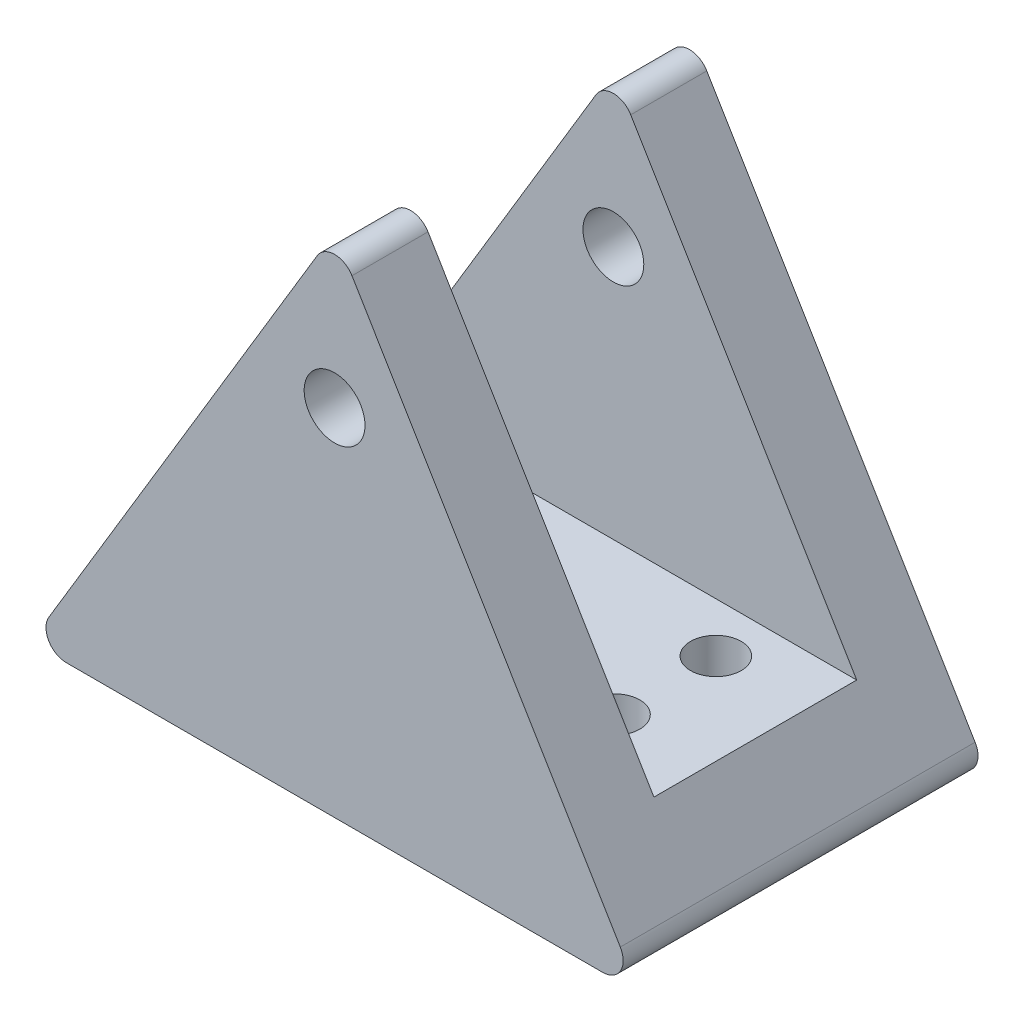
ISO-10303-21;
HEADER;
FILE_DESCRIPTION(('STEP AP214'),'2;1');
FILE_NAME('part.step','',(''),(''),'','','');
FILE_SCHEMA(('AUTOMOTIVE_DESIGN { 1 0 10303 214 1 1 1 1 }'));
ENDSEC;
DATA;
#1=APPLICATION_CONTEXT('core data for automotive mechanical design processes');
#2=APPLICATION_PROTOCOL_DEFINITION('international standard','automotive_design',2000,#1);
#3=PRODUCT_CONTEXT('',#1,'mechanical');
#4=PRODUCT('Part','Part','',(#3));
#5=PRODUCT_RELATED_PRODUCT_CATEGORY('part','',(#4));
#6=PRODUCT_DEFINITION_FORMATION('','',#4);
#7=PRODUCT_DEFINITION_CONTEXT('part definition',#1,'design');
#8=PRODUCT_DEFINITION('design','',#6,#7);
#9=PRODUCT_DEFINITION_SHAPE('','',#8);
#10=(LENGTH_UNIT() NAMED_UNIT(*) SI_UNIT(.MILLI.,.METRE.));
#11=(NAMED_UNIT(*) PLANE_ANGLE_UNIT() SI_UNIT($,.RADIAN.));
#12=(NAMED_UNIT(*) SI_UNIT($,.STERADIAN.) SOLID_ANGLE_UNIT());
#13=UNCERTAINTY_MEASURE_WITH_UNIT(LENGTH_MEASURE(1.E-05),#10,'distance_accuracy_value','');
#14=(GEOMETRIC_REPRESENTATION_CONTEXT(3) GLOBAL_UNCERTAINTY_ASSIGNED_CONTEXT((#13)) GLOBAL_UNIT_ASSIGNED_CONTEXT((#10,
#11,#12)) REPRESENTATION_CONTEXT('',''));
#15=CARTESIAN_POINT('',(0.,0.,0.));
#16=DIRECTION('',(0.,0.,1.));
#17=DIRECTION('',(1.,0.,0.));
#18=AXIS2_PLACEMENT_3D('',#15,#16,#17);
#19=CARTESIAN_POINT('',(-38.1,-31.75,44.45));
#20=DIRECTION('',(0.,1.,0.));
#21=DIRECTION('',(0.,0.,1.));
#22=AXIS2_PLACEMENT_3D('',#19,#20,#21);
#23=PLANE('',#22);
#24=CARTESIAN_POINT('',(-19.05,-31.75,28.4370332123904));
#25=DIRECTION('',(0.,1.,0.));
#26=DIRECTION('',(0.,0.,1.));
#27=AXIS2_PLACEMENT_3D('',#24,#25,#26);
#28=CIRCLE('',#27,3.17499999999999);
#29=CARTESIAN_POINT('',(-19.05,-31.75,31.6120332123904));
#30=VERTEX_POINT('',#29);
#31=EDGE_CURVE('E206',#30,#30,#28,.T.);
#32=ORIENTED_EDGE('',*,*,#31,.T.);
#33=EDGE_LOOP('',(#32));
#34=FACE_BOUND('',#33,.T.);
#35=CARTESIAN_POINT('',(19.05,-31.75,28.4370332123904));
#36=DIRECTION('',(0.,1.,0.));
#37=DIRECTION('',(0.,0.,1.));
#38=AXIS2_PLACEMENT_3D('',#35,#36,#37);
#39=CIRCLE('',#38,3.175);
#40=CARTESIAN_POINT('',(19.05,-31.75,31.6120332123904));
#41=VERTEX_POINT('',#40);
#42=EDGE_CURVE('E210',#41,#41,#39,.T.);
#43=ORIENTED_EDGE('',*,*,#42,.T.);
#44=EDGE_LOOP('',(#43));
#45=FACE_BOUND('',#44,.T.);
#46=CARTESIAN_POINT('',(19.05,-31.75,15.7370332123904));
#47=DIRECTION('',(0.,1.,0.));
#48=DIRECTION('',(0.,0.,1.));
#49=AXIS2_PLACEMENT_3D('',#46,#47,#48);
#50=CIRCLE('',#49,3.175);
#51=CARTESIAN_POINT('',(19.05,-31.75,18.9120332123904));
#52=VERTEX_POINT('',#51);
#53=EDGE_CURVE('E213',#52,#52,#50,.T.);
#54=ORIENTED_EDGE('',*,*,#53,.T.);
#55=EDGE_LOOP('',(#54));
#56=FACE_BOUND('',#55,.T.);
#57=CARTESIAN_POINT('',(-19.05,-31.75,15.7370332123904));
#58=DIRECTION('',(0.,1.,0.));
#59=DIRECTION('',(0.,0.,1.));
#60=AXIS2_PLACEMENT_3D('',#57,#58,#59);
#61=CIRCLE('',#60,3.175);
#62=CARTESIAN_POINT('',(-19.05,-31.75,18.9120332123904));
#63=VERTEX_POINT('',#62);
#64=EDGE_CURVE('E216',#63,#63,#61,.T.);
#65=ORIENTED_EDGE('',*,*,#64,.T.);
#66=EDGE_LOOP('',(#65));
#67=FACE_BOUND('',#66,.T.);
#68=DIRECTION('',(1.,0.,0.));
#69=VECTOR('',#68,1.);
#70=CARTESIAN_POINT('',(-38.1,-31.75,0.));
#71=LINE('',#70,#69);
#72=CARTESIAN_POINT('',(-33.6138764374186,-31.75,0.));
#73=VERTEX_POINT('',#72);
#74=CARTESIAN_POINT('',(33.6138764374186,-31.75,0.));
#75=VERTEX_POINT('',#74);
#76=EDGE_CURVE('E138',#73,#75,#71,.T.);
#77=ORIENTED_EDGE('',*,*,#76,.T.);
#78=DIRECTION('',(0.,0.,-1.));
#79=VECTOR('',#78,1.);
#80=CARTESIAN_POINT('',(33.6138764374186,-31.75,44.45));
#81=LINE('',#80,#79);
#82=CARTESIAN_POINT('',(33.6138764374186,-31.75,44.45));
#83=VERTEX_POINT('',#82);
#84=EDGE_CURVE('E170',#75,#83,#81,.F.);
#85=ORIENTED_EDGE('',*,*,#84,.T.);
#86=DIRECTION('',(1.,0.,0.));
#87=VECTOR('',#86,1.);
#88=CARTESIAN_POINT('',(-38.1,-31.75,44.45));
#89=LINE('',#88,#87);
#90=CARTESIAN_POINT('',(-33.6138764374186,-31.75,44.45));
#91=VERTEX_POINT('',#90);
#92=EDGE_CURVE('E142',#91,#83,#89,.T.);
#93=ORIENTED_EDGE('',*,*,#92,.F.);
#94=DIRECTION('',(0.,0.,-1.));
#95=VECTOR('',#94,1.);
#96=CARTESIAN_POINT('',(-33.6138764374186,-31.75,44.45));
#97=LINE('',#96,#95);
#98=EDGE_CURVE('E167',#91,#73,#97,.T.);
#99=ORIENTED_EDGE('',*,*,#98,.T.);
#100=EDGE_LOOP('',(#77,#85,#93,#99));
#101=FACE_BOUND('',#100,.T.);
#102=ADVANCED_FACE('F34',(#34,#45,#56,#67,#101),#23,.F.);
#103=CARTESIAN_POINT('',(0.,0.,44.45));
#104=DIRECTION('',(0.,0.,1.));
#105=DIRECTION('',(1.,0.,0.));
#106=AXIS2_PLACEMENT_3D('',#103,#104,#105);
#107=PLANE('',#106);
#108=CARTESIAN_POINT('',(0.,12.7,44.45));
#109=DIRECTION('',(0.,0.,1.));
#110=DIRECTION('',(1.,0.,0.));
#111=AXIS2_PLACEMENT_3D('',#108,#109,#110);
#112=CIRCLE('',#111,3.81);
#113=CARTESIAN_POINT('',(3.81,12.7,44.45));
#114=VERTEX_POINT('',#113);
#115=EDGE_CURVE('E233',#114,#114,#112,.T.);
#116=ORIENTED_EDGE('',*,*,#115,.F.);
#117=EDGE_LOOP('',(#116));
#118=FACE_BOUND('',#117,.T.);
#119=ORIENTED_EDGE('',*,*,#92,.T.);
#120=CARTESIAN_POINT('',(33.6138764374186,-29.21,44.45));
#121=DIRECTION('',(0.,0.,1.));
#122=DIRECTION('',(1.,0.,0.));
#123=AXIS2_PLACEMENT_3D('',#120,#121,#122);
#124=CIRCLE('',#123,2.54);
#125=CARTESIAN_POINT('',(35.7919084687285,-27.9031807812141,44.45));
#126=VERTEX_POINT('',#125);
#127=EDGE_CURVE('E176',#83,#126,#124,.T.);
#128=ORIENTED_EDGE('',*,*,#127,.T.);
#129=DIRECTION('',(0.514495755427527,-0.857492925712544,0.));
#130=VECTOR('',#129,1.);
#131=CARTESIAN_POINT('',(0.,31.75,44.45));
#132=LINE('',#131,#130);
#133=CARTESIAN_POINT('',(2.17803203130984,28.1199466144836,44.45));
#134=VERTEX_POINT('',#133);
#135=EDGE_CURVE('E204',#134,#126,#132,.T.);
#136=ORIENTED_EDGE('',*,*,#135,.F.);
#137=CARTESIAN_POINT('',(0.,26.8131273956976,44.45));
#138=DIRECTION('',(0.,0.,1.));
#139=DIRECTION('',(1.,0.,0.));
#140=AXIS2_PLACEMENT_3D('',#137,#138,#139);
#141=CIRCLE('',#140,2.54);
#142=CARTESIAN_POINT('',(-2.17803203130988,28.1199466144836,44.45));
#143=VERTEX_POINT('',#142);
#144=EDGE_CURVE('E174',#134,#143,#141,.T.);
#145=ORIENTED_EDGE('',*,*,#144,.T.);
#146=DIRECTION('',(0.514495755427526,0.857492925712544,0.));
#147=VECTOR('',#146,1.);
#148=CARTESIAN_POINT('',(-38.1,-31.75,44.45));
#149=LINE('',#148,#147);
#150=CARTESIAN_POINT('',(-35.7919084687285,-27.9031807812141,44.45));
#151=VERTEX_POINT('',#150);
#152=EDGE_CURVE('E195',#151,#143,#149,.T.);
#153=ORIENTED_EDGE('',*,*,#152,.F.);
#154=CARTESIAN_POINT('',(-33.6138764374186,-29.21,44.45));
#155=DIRECTION('',(0.,0.,1.));
#156=DIRECTION('',(1.,0.,0.));
#157=AXIS2_PLACEMENT_3D('',#154,#155,#156);
#158=CIRCLE('',#157,2.54);
#159=EDGE_CURVE('E172',#151,#91,#158,.T.);
#160=ORIENTED_EDGE('',*,*,#159,.T.);
#161=EDGE_LOOP('',(#119,#128,#136,#145,#153,#160));
#162=FACE_BOUND('',#161,.T.);
#163=ADVANCED_FACE('F256',(#118,#162),#107,.T.);
#164=CARTESIAN_POINT('',(0.,0.,0.));
#165=DIRECTION('',(0.,0.,1.));
#166=DIRECTION('',(1.,0.,0.));
#167=AXIS2_PLACEMENT_3D('',#164,#165,#166);
#168=PLANE('',#167);
#169=CARTESIAN_POINT('',(0.,12.7,0.));
#170=DIRECTION('',(0.,0.,1.));
#171=DIRECTION('',(1.,0.,0.));
#172=AXIS2_PLACEMENT_3D('',#169,#170,#171);
#173=CIRCLE('',#172,3.81);
#174=CARTESIAN_POINT('',(3.81,12.7,0.));
#175=VERTEX_POINT('',#174);
#176=EDGE_CURVE('E154',#175,#175,#173,.T.);
#177=ORIENTED_EDGE('',*,*,#176,.T.);
#178=EDGE_LOOP('',(#177));
#179=FACE_BOUND('',#178,.T.);
#180=DIRECTION('',(0.514495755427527,-0.857492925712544,0.));
#181=VECTOR('',#180,1.);
#182=CARTESIAN_POINT('',(0.,31.75,0.));
#183=LINE('',#182,#181);
#184=CARTESIAN_POINT('',(2.17803203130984,28.1199466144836,0.));
#185=VERTEX_POINT('',#184);
#186=CARTESIAN_POINT('',(35.7919084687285,-27.9031807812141,0.));
#187=VERTEX_POINT('',#186);
#188=EDGE_CURVE('E120',#185,#187,#183,.T.);
#189=ORIENTED_EDGE('',*,*,#188,.T.);
#190=CARTESIAN_POINT('',(33.6138764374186,-29.21,0.));
#191=DIRECTION('',(0.,0.,1.));
#192=DIRECTION('',(1.,0.,0.));
#193=AXIS2_PLACEMENT_3D('',#190,#191,#192);
#194=CIRCLE('',#193,2.54);
#195=EDGE_CURVE('E165',#187,#75,#194,.F.);
#196=ORIENTED_EDGE('',*,*,#195,.T.);
#197=ORIENTED_EDGE('',*,*,#76,.F.);
#198=CARTESIAN_POINT('',(-33.6138764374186,-29.21,0.));
#199=DIRECTION('',(0.,0.,1.));
#200=DIRECTION('',(1.,0.,0.));
#201=AXIS2_PLACEMENT_3D('',#198,#199,#200);
#202=CIRCLE('',#201,2.54);
#203=CARTESIAN_POINT('',(-35.7919084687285,-27.9031807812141,0.));
#204=VERTEX_POINT('',#203);
#205=EDGE_CURVE('E161',#73,#204,#202,.F.);
#206=ORIENTED_EDGE('',*,*,#205,.T.);
#207=DIRECTION('',(0.514495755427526,0.857492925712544,0.));
#208=VECTOR('',#207,1.);
#209=CARTESIAN_POINT('',(-38.1,-31.75,0.));
#210=LINE('',#209,#208);
#211=CARTESIAN_POINT('',(-2.17803203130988,28.1199466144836,0.));
#212=VERTEX_POINT('',#211);
#213=EDGE_CURVE('E186',#204,#212,#210,.T.);
#214=ORIENTED_EDGE('',*,*,#213,.T.);
#215=CARTESIAN_POINT('',(0.,26.8131273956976,0.));
#216=DIRECTION('',(0.,0.,1.));
#217=DIRECTION('',(1.,0.,0.));
#218=AXIS2_PLACEMENT_3D('',#215,#216,#217);
#219=CIRCLE('',#218,2.54);
#220=EDGE_CURVE('E163',#212,#185,#219,.F.);
#221=ORIENTED_EDGE('',*,*,#220,.T.);
#222=EDGE_LOOP('',(#189,#196,#197,#206,#214,#221));
#223=FACE_BOUND('',#222,.T.);
#224=ADVANCED_FACE('F192',(#179,#223),#168,.F.);
#225=CARTESIAN_POINT('',(-38.1,31.75,9.52500000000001));
#226=DIRECTION('',(0.,0.,-1.));
#227=DIRECTION('',(0.,1.,0.));
#228=AXIS2_PLACEMENT_3D('',#225,#226,#227);
#229=PLANE('',#228);
#230=CARTESIAN_POINT('',(0.,12.7,9.525));
#231=DIRECTION('',(0.,0.,-1.));
#232=DIRECTION('',(0.,1.,0.));
#233=AXIS2_PLACEMENT_3D('',#230,#231,#232);
#234=CIRCLE('',#233,3.81);
#235=CARTESIAN_POINT('',(0.,16.51,9.525));
#236=VERTEX_POINT('',#235);
#237=EDGE_CURVE('E153',#236,#236,#234,.T.);
#238=ORIENTED_EDGE('',*,*,#237,.T.);
#239=EDGE_LOOP('',(#238));
#240=FACE_BOUND('',#239,.T.);
#241=DIRECTION('',(-0.514495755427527,0.857492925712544,0.));
#242=VECTOR('',#241,1.);
#243=CARTESIAN_POINT('',(-10.0852941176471,48.5588235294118,9.52500000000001));
#244=LINE('',#243,#242);
#245=CARTESIAN_POINT('',(30.48,-19.05,9.52499999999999));
#246=VERTEX_POINT('',#245);
#247=CARTESIAN_POINT('',(2.17803203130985,28.1199466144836,9.52500000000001));
#248=VERTEX_POINT('',#247);
#249=EDGE_CURVE('E126',#246,#248,#244,.T.);
#250=ORIENTED_EDGE('',*,*,#249,.T.);
#251=CARTESIAN_POINT('',(0.,26.8131273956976,9.525));
#252=DIRECTION('',(0.,0.,-1.));
#253=DIRECTION('',(0.,1.,0.));
#254=AXIS2_PLACEMENT_3D('',#251,#252,#253);
#255=CIRCLE('',#254,2.54);
#256=CARTESIAN_POINT('',(-2.17803203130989,28.1199466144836,9.525));
#257=VERTEX_POINT('',#256);
#258=EDGE_CURVE('E11',#248,#257,#255,.F.);
#259=ORIENTED_EDGE('',*,*,#258,.T.);
#260=DIRECTION('',(-0.514495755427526,-0.857492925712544,0.));
#261=VECTOR('',#260,1.);
#262=CARTESIAN_POINT('',(-10.0852941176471,14.9411764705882,9.525));
#263=LINE('',#262,#261);
#264=CARTESIAN_POINT('',(-30.48,-19.05,9.52499999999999));
#265=VERTEX_POINT('',#264);
#266=EDGE_CURVE('E136',#257,#265,#263,.T.);
#267=ORIENTED_EDGE('',*,*,#266,.T.);
#268=DIRECTION('',(1.,0.,0.));
#269=VECTOR('',#268,1.);
#270=CARTESIAN_POINT('',(-38.1,-19.05,9.52499999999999));
#271=LINE('',#270,#269);
#272=EDGE_CURVE('E135',#265,#246,#271,.T.);
#273=ORIENTED_EDGE('',*,*,#272,.T.);
#274=EDGE_LOOP('',(#250,#259,#267,#273));
#275=FACE_BOUND('',#274,.T.);
#276=ADVANCED_FACE('F199',(#240,#275),#229,.F.);
#277=CARTESIAN_POINT('',(-38.1,-19.05,34.925));
#278=DIRECTION('',(0.,-1.,0.));
#279=DIRECTION('',(0.,0.,-1.));
#280=AXIS2_PLACEMENT_3D('',#277,#278,#279);
#281=PLANE('',#280);
#282=CARTESIAN_POINT('',(-19.05,-19.05,28.4370332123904));
#283=DIRECTION('',(0.,1.,0.));
#284=DIRECTION('',(1.,0.,0.));
#285=AXIS2_PLACEMENT_3D('',#282,#283,#284);
#286=CIRCLE('',#285,3.17499999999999);
#287=CARTESIAN_POINT('',(-15.875,-19.05,28.4370332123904));
#288=VERTEX_POINT('',#287);
#289=EDGE_CURVE('E223',#288,#288,#286,.T.);
#290=ORIENTED_EDGE('',*,*,#289,.F.);
#291=EDGE_LOOP('',(#290));
#292=FACE_BOUND('',#291,.T.);
#293=CARTESIAN_POINT('',(19.05,-19.05,28.4370332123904));
#294=DIRECTION('',(0.,1.,0.));
#295=DIRECTION('',(-1.,0.,0.));
#296=AXIS2_PLACEMENT_3D('',#293,#294,#295);
#297=CIRCLE('',#296,3.175);
#298=CARTESIAN_POINT('',(15.875,-19.05,28.4370332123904));
#299=VERTEX_POINT('',#298);
#300=EDGE_CURVE('E226',#299,#299,#297,.T.);
#301=ORIENTED_EDGE('',*,*,#300,.F.);
#302=EDGE_LOOP('',(#301));
#303=FACE_BOUND('',#302,.T.);
#304=CARTESIAN_POINT('',(19.05,-19.05,15.7370332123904));
#305=DIRECTION('',(0.,1.,0.));
#306=DIRECTION('',(1.,0.,0.));
#307=AXIS2_PLACEMENT_3D('',#304,#305,#306);
#308=CIRCLE('',#307,3.175);
#309=CARTESIAN_POINT('',(22.225,-19.05,15.7370332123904));
#310=VERTEX_POINT('',#309);
#311=EDGE_CURVE('E222',#310,#310,#308,.T.);
#312=ORIENTED_EDGE('',*,*,#311,.F.);
#313=EDGE_LOOP('',(#312));
#314=FACE_BOUND('',#313,.T.);
#315=CARTESIAN_POINT('',(-19.05,-19.05,15.7370332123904));
#316=DIRECTION('',(0.,1.,0.));
#317=DIRECTION('',(-1.,0.,0.));
#318=AXIS2_PLACEMENT_3D('',#315,#316,#317);
#319=CIRCLE('',#318,3.175);
#320=CARTESIAN_POINT('',(-22.225,-19.05,15.7370332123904));
#321=VERTEX_POINT('',#320);
#322=EDGE_CURVE('E219',#321,#321,#319,.T.);
#323=ORIENTED_EDGE('',*,*,#322,.F.);
#324=EDGE_LOOP('',(#323));
#325=FACE_BOUND('',#324,.T.);
#326=DIRECTION('',(1.,0.,0.));
#327=VECTOR('',#326,1.);
#328=CARTESIAN_POINT('',(-38.1,-19.05,34.925));
#329=LINE('',#328,#327);
#330=CARTESIAN_POINT('',(-30.48,-19.05,34.925));
#331=VERTEX_POINT('',#330);
#332=CARTESIAN_POINT('',(30.48,-19.05,34.925));
#333=VERTEX_POINT('',#332);
#334=EDGE_CURVE('E114',#331,#333,#329,.T.);
#335=ORIENTED_EDGE('',*,*,#334,.T.);
#336=DIRECTION('',(0.,0.,-1.));
#337=VECTOR('',#336,1.);
#338=CARTESIAN_POINT('',(30.48,-19.05,34.925));
#339=LINE('',#338,#337);
#340=EDGE_CURVE('E119',#333,#246,#339,.T.);
#341=ORIENTED_EDGE('',*,*,#340,.T.);
#342=ORIENTED_EDGE('',*,*,#272,.F.);
#343=DIRECTION('',(0.,0.,1.));
#344=VECTOR('',#343,1.);
#345=CARTESIAN_POINT('',(-30.48,-19.05,34.925));
#346=LINE('',#345,#344);
#347=EDGE_CURVE('E134',#265,#331,#346,.T.);
#348=ORIENTED_EDGE('',*,*,#347,.T.);
#349=EDGE_LOOP('',(#335,#341,#342,#348));
#350=FACE_BOUND('',#349,.T.);
#351=ADVANCED_FACE('F132',(#292,#303,#314,#325,#350),#281,.F.);
#352=CARTESIAN_POINT('',(-38.1,-19.05,34.925));
#353=DIRECTION('',(0.,0.,1.));
#354=DIRECTION('',(1.,0.,0.));
#355=AXIS2_PLACEMENT_3D('',#352,#353,#354);
#356=PLANE('',#355);
#357=CARTESIAN_POINT('',(0.,12.7,34.925));
#358=DIRECTION('',(0.,0.,1.));
#359=DIRECTION('',(1.,0.,0.));
#360=AXIS2_PLACEMENT_3D('',#357,#358,#359);
#361=CIRCLE('',#360,3.81);
#362=CARTESIAN_POINT('',(3.81,12.7,34.925));
#363=VERTEX_POINT('',#362);
#364=EDGE_CURVE('E150',#363,#363,#361,.T.);
#365=ORIENTED_EDGE('',*,*,#364,.T.);
#366=EDGE_LOOP('',(#365));
#367=FACE_BOUND('',#366,.T.);
#368=DIRECTION('',(0.514495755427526,0.857492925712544,0.));
#369=VECTOR('',#368,1.);
#370=CARTESIAN_POINT('',(-32.4970588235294,-22.4117647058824,34.925));
#371=LINE('',#370,#369);
#372=CARTESIAN_POINT('',(-2.17803203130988,28.1199466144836,34.925));
#373=VERTEX_POINT('',#372);
#374=EDGE_CURVE('E145',#331,#373,#371,.T.);
#375=ORIENTED_EDGE('',*,*,#374,.T.);
#376=CARTESIAN_POINT('',(0.,26.8131273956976,34.925));
#377=DIRECTION('',(0.,0.,1.));
#378=DIRECTION('',(1.,0.,0.));
#379=AXIS2_PLACEMENT_3D('',#376,#377,#378);
#380=CIRCLE('',#379,2.54);
#381=CARTESIAN_POINT('',(2.17803203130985,28.1199466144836,34.925));
#382=VERTEX_POINT('',#381);
#383=EDGE_CURVE('E42',#373,#382,#380,.F.);
#384=ORIENTED_EDGE('',*,*,#383,.T.);
#385=DIRECTION('',(0.514495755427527,-0.857492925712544,0.));
#386=VECTOR('',#385,1.);
#387=CARTESIAN_POINT('',(12.3264705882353,11.2058823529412,34.925));
#388=LINE('',#387,#386);
#389=EDGE_CURVE('E110',#382,#333,#388,.T.);
#390=ORIENTED_EDGE('',*,*,#389,.T.);
#391=ORIENTED_EDGE('',*,*,#334,.F.);
#392=EDGE_LOOP('',(#375,#384,#390,#391));
#393=FACE_BOUND('',#392,.T.);
#394=ADVANCED_FACE('F112',(#367,#393),#356,.F.);
#395=CARTESIAN_POINT('',(-38.1,-31.75,0.));
#396=DIRECTION('',(0.857492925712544,-0.514495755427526,0.));
#397=DIRECTION('',(0.514495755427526,0.857492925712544,0.));
#398=AXIS2_PLACEMENT_3D('',#395,#396,#397);
#399=PLANE('',#398);
#400=ORIENTED_EDGE('',*,*,#152,.T.);
#401=DIRECTION('',(0.,0.,1.));
#402=VECTOR('',#401,1.);
#403=CARTESIAN_POINT('',(-2.17803203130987,28.1199466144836,0.));
#404=LINE('',#403,#402);
#405=EDGE_CURVE('E55',#143,#373,#404,.F.);
#406=ORIENTED_EDGE('',*,*,#405,.T.);
#407=ORIENTED_EDGE('',*,*,#374,.F.);
#408=ORIENTED_EDGE('',*,*,#347,.F.);
#409=ORIENTED_EDGE('',*,*,#266,.F.);
#410=DIRECTION('',(0.,0.,1.));
#411=VECTOR('',#410,1.);
#412=CARTESIAN_POINT('',(-2.17803203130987,28.1199466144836,0.));
#413=LINE('',#412,#411);
#414=EDGE_CURVE('E180',#257,#212,#413,.F.);
#415=ORIENTED_EDGE('',*,*,#414,.T.);
#416=ORIENTED_EDGE('',*,*,#213,.F.);
#417=DIRECTION('',(0.,0.,-1.));
#418=VECTOR('',#417,1.);
#419=CARTESIAN_POINT('',(-35.7919084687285,-27.9031807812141,0.));
#420=LINE('',#419,#418);
#421=EDGE_CURVE('E178',#204,#151,#420,.F.);
#422=ORIENTED_EDGE('',*,*,#421,.T.);
#423=EDGE_LOOP('',(#400,#406,#407,#408,#409,#415,#416,#422));
#424=FACE_BOUND('',#423,.T.);
#425=ADVANCED_FACE('F185',(#424),#399,.F.);
#426=CARTESIAN_POINT('',(0.,31.75,0.));
#427=DIRECTION('',(-0.857492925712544,-0.514495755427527,0.));
#428=DIRECTION('',(0.514495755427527,-0.857492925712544,0.));
#429=AXIS2_PLACEMENT_3D('',#426,#427,#428);
#430=PLANE('',#429);
#431=ORIENTED_EDGE('',*,*,#135,.T.);
#432=DIRECTION('',(0.,0.,-1.));
#433=VECTOR('',#432,1.);
#434=CARTESIAN_POINT('',(35.7919084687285,-27.9031807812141,0.));
#435=LINE('',#434,#433);
#436=EDGE_CURVE('E158',#126,#187,#435,.T.);
#437=ORIENTED_EDGE('',*,*,#436,.T.);
#438=ORIENTED_EDGE('',*,*,#188,.F.);
#439=DIRECTION('',(0.,0.,1.));
#440=VECTOR('',#439,1.);
#441=CARTESIAN_POINT('',(2.17803203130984,28.1199466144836,0.));
#442=LINE('',#441,#440);
#443=EDGE_CURVE('E149',#185,#248,#442,.T.);
#444=ORIENTED_EDGE('',*,*,#443,.T.);
#445=ORIENTED_EDGE('',*,*,#249,.F.);
#446=ORIENTED_EDGE('',*,*,#340,.F.);
#447=ORIENTED_EDGE('',*,*,#389,.F.);
#448=DIRECTION('',(0.,0.,1.));
#449=VECTOR('',#448,1.);
#450=CARTESIAN_POINT('',(2.17803203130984,28.1199466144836,0.));
#451=LINE('',#450,#449);
#452=EDGE_CURVE('E156',#382,#134,#451,.T.);
#453=ORIENTED_EDGE('',*,*,#452,.T.);
#454=EDGE_LOOP('',(#431,#437,#438,#444,#445,#446,#447,#453));
#455=FACE_BOUND('',#454,.T.);
#456=ADVANCED_FACE('F124',(#455),#430,.F.);
#457=CARTESIAN_POINT('',(-19.05,-63.5,15.7370332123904));
#458=DIRECTION('',(0.,1.,0.));
#459=DIRECTION('',(-1.,0.,0.));
#460=AXIS2_PLACEMENT_3D('',#457,#458,#459);
#461=CYLINDRICAL_SURFACE('',#460,3.175);
#462=ORIENTED_EDGE('',*,*,#322,.T.);
#463=EDGE_LOOP('',(#462));
#464=FACE_BOUND('',#463,.T.);
#465=ORIENTED_EDGE('',*,*,#64,.F.);
#466=EDGE_LOOP('',(#465));
#467=FACE_BOUND('',#466,.T.);
#468=ADVANCED_FACE('F318',(#464,#467),#461,.F.);
#469=CARTESIAN_POINT('',(19.05,-63.5,15.7370332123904));
#470=DIRECTION('',(0.,1.,0.));
#471=DIRECTION('',(-1.,0.,0.));
#472=AXIS2_PLACEMENT_3D('',#469,#470,#471);
#473=CYLINDRICAL_SURFACE('',#472,3.175);
#474=ORIENTED_EDGE('',*,*,#311,.T.);
#475=EDGE_LOOP('',(#474));
#476=FACE_BOUND('',#475,.T.);
#477=ORIENTED_EDGE('',*,*,#53,.F.);
#478=EDGE_LOOP('',(#477));
#479=FACE_BOUND('',#478,.T.);
#480=ADVANCED_FACE('F390',(#476,#479),#473,.F.);
#481=CARTESIAN_POINT('',(19.05,-63.5,28.4370332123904));
#482=DIRECTION('',(0.,1.,0.));
#483=DIRECTION('',(-1.,0.,0.));
#484=AXIS2_PLACEMENT_3D('',#481,#482,#483);
#485=CYLINDRICAL_SURFACE('',#484,3.175);
#486=ORIENTED_EDGE('',*,*,#300,.T.);
#487=EDGE_LOOP('',(#486));
#488=FACE_BOUND('',#487,.T.);
#489=ORIENTED_EDGE('',*,*,#42,.F.);
#490=EDGE_LOOP('',(#489));
#491=FACE_BOUND('',#490,.T.);
#492=ADVANCED_FACE('F380',(#488,#491),#485,.F.);
#493=CARTESIAN_POINT('',(-19.05,-63.5,28.4370332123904));
#494=DIRECTION('',(0.,1.,0.));
#495=DIRECTION('',(-1.,0.,0.));
#496=AXIS2_PLACEMENT_3D('',#493,#494,#495);
#497=CYLINDRICAL_SURFACE('',#496,3.17499999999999);
#498=ORIENTED_EDGE('',*,*,#289,.T.);
#499=EDGE_LOOP('',(#498));
#500=FACE_BOUND('',#499,.T.);
#501=ORIENTED_EDGE('',*,*,#31,.F.);
#502=EDGE_LOOP('',(#501));
#503=FACE_BOUND('',#502,.T.);
#504=ADVANCED_FACE('F371',(#500,#503),#497,.F.);
#505=CARTESIAN_POINT('',(0.,12.7,0.));
#506=DIRECTION('',(0.,0.,1.));
#507=DIRECTION('',(1.,0.,0.));
#508=AXIS2_PLACEMENT_3D('',#505,#506,#507);
#509=CYLINDRICAL_SURFACE('',#508,3.81);
#510=ORIENTED_EDGE('',*,*,#115,.T.);
#511=EDGE_LOOP('',(#510));
#512=FACE_BOUND('',#511,.T.);
#513=ORIENTED_EDGE('',*,*,#364,.F.);
#514=EDGE_LOOP('',(#513));
#515=FACE_BOUND('',#514,.T.);
#516=ADVANCED_FACE('F244',(#512,#515),#509,.F.);
#517=ORIENTED_EDGE('',*,*,#176,.F.);
#518=EDGE_LOOP('',(#517));
#519=FACE_BOUND('',#518,.T.);
#520=ORIENTED_EDGE('',*,*,#237,.F.);
#521=EDGE_LOOP('',(#520));
#522=FACE_BOUND('',#521,.T.);
#523=ADVANCED_FACE('F240',(#519,#522),#509,.F.);
#524=CARTESIAN_POINT('',(33.6138764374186,-29.21,0.));
#525=DIRECTION('',(0.,0.,-1.));
#526=DIRECTION('',(-1.,0.,0.));
#527=AXIS2_PLACEMENT_3D('',#524,#525,#526);
#528=CYLINDRICAL_SURFACE('',#527,2.54);
#529=ORIENTED_EDGE('',*,*,#127,.F.);
#530=ORIENTED_EDGE('',*,*,#84,.F.);
#531=ORIENTED_EDGE('',*,*,#195,.F.);
#532=ORIENTED_EDGE('',*,*,#436,.F.);
#533=EDGE_LOOP('',(#529,#530,#531,#532));
#534=FACE_BOUND('',#533,.T.);
#535=ADVANCED_FACE('F243',(#534),#528,.T.);
#536=CARTESIAN_POINT('',(0.,26.8131273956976,0.));
#537=DIRECTION('',(0.,0.,1.));
#538=DIRECTION('',(1.,0.,0.));
#539=AXIS2_PLACEMENT_3D('',#536,#537,#538);
#540=CYLINDRICAL_SURFACE('',#539,2.54);
#541=ORIENTED_EDGE('',*,*,#383,.F.);
#542=ORIENTED_EDGE('',*,*,#405,.F.);
#543=ORIENTED_EDGE('',*,*,#144,.F.);
#544=ORIENTED_EDGE('',*,*,#452,.F.);
#545=EDGE_LOOP('',(#541,#542,#543,#544));
#546=FACE_BOUND('',#545,.T.);
#547=ADVANCED_FACE('F271',(#546),#540,.T.);
#548=CARTESIAN_POINT('',(0.,26.8131273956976,0.));
#549=DIRECTION('',(0.,0.,1.));
#550=DIRECTION('',(1.,0.,0.));
#551=AXIS2_PLACEMENT_3D('',#548,#549,#550);
#552=CYLINDRICAL_SURFACE('',#551,2.54);
#553=ORIENTED_EDGE('',*,*,#220,.F.);
#554=ORIENTED_EDGE('',*,*,#414,.F.);
#555=ORIENTED_EDGE('',*,*,#258,.F.);
#556=ORIENTED_EDGE('',*,*,#443,.F.);
#557=EDGE_LOOP('',(#553,#554,#555,#556));
#558=FACE_BOUND('',#557,.T.);
#559=ADVANCED_FACE('F198',(#558),#552,.T.);
#560=CARTESIAN_POINT('',(-33.6138764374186,-29.21,44.45));
#561=DIRECTION('',(0.,0.,-1.));
#562=DIRECTION('',(-1.,0.,0.));
#563=AXIS2_PLACEMENT_3D('',#560,#561,#562);
#564=CYLINDRICAL_SURFACE('',#563,2.54);
#565=ORIENTED_EDGE('',*,*,#159,.F.);
#566=ORIENTED_EDGE('',*,*,#421,.F.);
#567=ORIENTED_EDGE('',*,*,#205,.F.);
#568=ORIENTED_EDGE('',*,*,#98,.F.);
#569=EDGE_LOOP('',(#565,#566,#567,#568));
#570=FACE_BOUND('',#569,.T.);
#571=ADVANCED_FACE('F36',(#570),#564,.T.);
#572=CLOSED_SHELL('',(#102,#163,#224,#276,#351,#394,#425,#456,#468,#480,#492,#504,#516,#523,
#535,#547,#559,#571));
#573=MANIFOLD_SOLID_BREP('B2',#572);
#574=ADVANCED_BREP_SHAPE_REPRESENTATION('',(#18,#573),#14);
#575=SHAPE_DEFINITION_REPRESENTATION(#9,#574);
ENDSEC;
END-ISO-10303-21;
